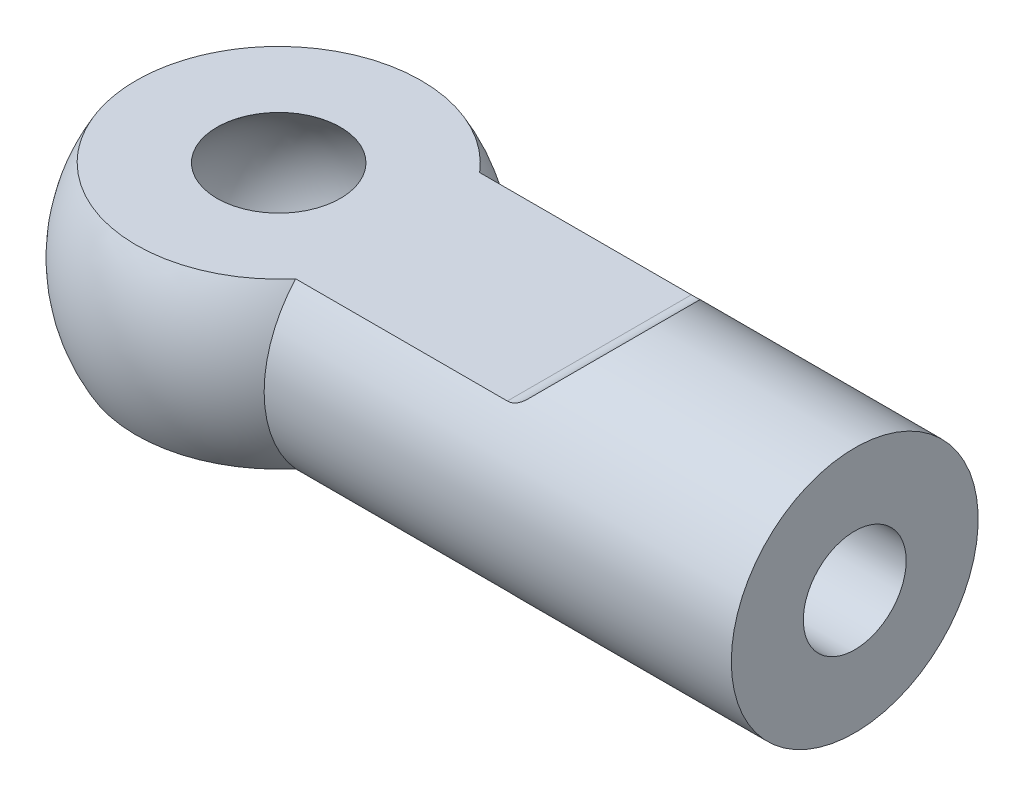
ISO-10303-21;
HEADER;
FILE_DESCRIPTION(('STEP AP214'),'2;1');
FILE_NAME('part.step','',(''),(''),'','','');
FILE_SCHEMA(('AUTOMOTIVE_DESIGN { 1 0 10303 214 1 1 1 1 }'));
ENDSEC;
DATA;
#1=APPLICATION_CONTEXT('core data for automotive mechanical design processes');
#2=APPLICATION_PROTOCOL_DEFINITION('international standard','automotive_design',2000,#1);
#3=PRODUCT_CONTEXT('',#1,'mechanical');
#4=PRODUCT('Part','Part','',(#3));
#5=PRODUCT_RELATED_PRODUCT_CATEGORY('part','',(#4));
#6=PRODUCT_DEFINITION_FORMATION('','',#4);
#7=PRODUCT_DEFINITION_CONTEXT('part definition',#1,'design');
#8=PRODUCT_DEFINITION('design','',#6,#7);
#9=PRODUCT_DEFINITION_SHAPE('','',#8);
#10=(LENGTH_UNIT() NAMED_UNIT(*) SI_UNIT(.MILLI.,.METRE.));
#11=(NAMED_UNIT(*) PLANE_ANGLE_UNIT() SI_UNIT($,.RADIAN.));
#12=(NAMED_UNIT(*) SI_UNIT($,.STERADIAN.) SOLID_ANGLE_UNIT());
#13=UNCERTAINTY_MEASURE_WITH_UNIT(LENGTH_MEASURE(1.E-05),#10,'distance_accuracy_value','');
#14=(GEOMETRIC_REPRESENTATION_CONTEXT(3) GLOBAL_UNCERTAINTY_ASSIGNED_CONTEXT((#13)) GLOBAL_UNIT_ASSIGNED_CONTEXT((#10,
#11,#12)) REPRESENTATION_CONTEXT('',''));
#15=CARTESIAN_POINT('',(0.,0.,0.));
#16=DIRECTION('',(0.,0.,1.));
#17=DIRECTION('',(1.,0.,0.));
#18=AXIS2_PLACEMENT_3D('',#15,#16,#17);
#19=CARTESIAN_POINT('',(0.,0.,0.));
#20=DIRECTION('',(-1.,0.,0.));
#21=DIRECTION('',(0.,0.,1.));
#22=AXIS2_PLACEMENT_3D('',#19,#20,#21);
#23=CYLINDRICAL_SURFACE('',#22,3.);
#24=CARTESIAN_POINT('',(14.,0.,0.));
#25=DIRECTION('',(-1.,0.,0.));
#26=DIRECTION('',(0.,0.,1.));
#27=AXIS2_PLACEMENT_3D('',#24,#25,#26);
#28=CIRCLE('',#27,3.);
#29=CARTESIAN_POINT('',(14.,0.,3.));
#30=VERTEX_POINT('',#29);
#31=EDGE_CURVE('E441',#30,#30,#28,.T.);
#32=ORIENTED_EDGE('',*,*,#31,.T.);
#33=EDGE_LOOP('',(#32));
#34=FACE_BOUND('',#33,.T.);
#35=DIRECTION('',(-1.,0.,0.));
#36=VECTOR('',#35,1.);
#37=CARTESIAN_POINT('',(0.,-2.,2.23606797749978));
#38=LINE('',#37,#36);
#39=CARTESIAN_POINT('',(2.6457513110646,-2.,2.23606797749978));
#40=VERTEX_POINT('',#39);
#41=CARTESIAN_POINT('',(7.79289321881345,-2.,2.23606797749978));
#42=VERTEX_POINT('',#41);
#43=EDGE_CURVE('E424',#40,#42,#38,.F.);
#44=ORIENTED_EDGE('',*,*,#43,.T.);
#45=CARTESIAN_POINT('',(7.79289321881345,-2.,2.23606797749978));
#46=CARTESIAN_POINT('',(7.81564348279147,-1.9999628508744,2.23609073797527));
#47=CARTESIAN_POINT('',(7.83835658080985,-2.00155029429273,2.23468148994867));
#48=CARTESIAN_POINT('',(7.88283202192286,-2.00765885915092,2.22920042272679));
#49=CARTESIAN_POINT('',(7.90460147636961,-2.01215122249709,2.22515470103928));
#50=CARTESIAN_POINT('',(7.94675574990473,-2.02375741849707,2.21460221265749));
#51=CARTESIAN_POINT('',(7.96714227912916,-2.03086794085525,2.20809855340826));
#52=CARTESIAN_POINT('',(8.00622199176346,-2.04729507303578,2.19287707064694));
#53=CARTESIAN_POINT('',(8.02490733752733,-2.05662124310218,2.1841496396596));
#54=CARTESIAN_POINT('',(8.06262231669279,-2.07835769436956,2.16348786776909));
#55=CARTESIAN_POINT('',(8.08135643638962,-2.09101453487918,2.15127938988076));
#56=CARTESIAN_POINT('',(8.11599095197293,-2.11778814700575,2.12493153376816));
#57=CARTESIAN_POINT('',(8.13190935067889,-2.13189465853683,2.11080552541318));
#58=CARTESIAN_POINT('',(8.14644660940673,-2.14644660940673,2.09589287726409));
#59=B_SPLINE_CURVE_WITH_KNOTS('',3,(#45,#46,#47,#48,#49,#50,#51,#52,#53,#54,#55,#56,#57,#58),
.UNSPECIFIED.,.F.,.F.,(4,2,2,2,2,2,4),(0.,0.0680932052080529,0.135522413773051,
0.202866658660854,0.270506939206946,0.347299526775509,0.423581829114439),.UNSPECIFIED.);
#60=CARTESIAN_POINT('',(8.14644660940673,-2.14644660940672,2.09589287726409));
#61=VERTEX_POINT('',#60);
#62=EDGE_CURVE('E11',#42,#61,#59,.T.);
#63=ORIENTED_EDGE('',*,*,#62,.T.);
#64=CARTESIAN_POINT('',(5.99999999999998,0.,0.));
#65=DIRECTION('',(0.707106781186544,0.707106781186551,0.));
#66=DIRECTION('',(-0.707106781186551,0.707106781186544,0.));
#67=AXIS2_PLACEMENT_3D('',#64,#65,#66);
#68=ELLIPSE('',#67,4.2426406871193,3.);
#69=CARTESIAN_POINT('',(8.14644660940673,-2.14644660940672,-2.09589287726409));
#70=VERTEX_POINT('',#69);
#71=EDGE_CURVE('E511',#61,#70,#68,.T.);
#72=ORIENTED_EDGE('',*,*,#71,.T.);
#73=CARTESIAN_POINT('',(8.14644660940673,-2.14644660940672,-2.09589287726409));
#74=CARTESIAN_POINT('',(8.13093845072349,-2.13091869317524,-2.11180744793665));
#75=CARTESIAN_POINT('',(8.1138494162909,-2.11589564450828,-2.12682631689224));
#76=CARTESIAN_POINT('',(8.07642523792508,-2.08749027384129,-2.15470922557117));
#77=CARTESIAN_POINT('',(8.05605806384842,-2.07412672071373,-2.16754912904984));
#78=CARTESIAN_POINT('',(8.01215742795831,-2.04993821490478,-2.19044220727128));
#79=CARTESIAN_POINT('',(7.98860137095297,-2.03913304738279,-2.20047376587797));
#80=CARTESIAN_POINT('',(7.93913757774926,-2.02114968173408,-2.21700335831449));
#81=CARTESIAN_POINT('',(7.91324645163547,-2.01394793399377,-2.22352435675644));
#82=CARTESIAN_POINT('',(7.87137788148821,-2.00595258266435,-2.23073297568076));
#83=CARTESIAN_POINT('',(7.85587806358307,-2.00373600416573,-2.23272226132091));
#84=CARTESIAN_POINT('',(7.82455572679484,-2.0007531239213,-2.23539443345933));
#85=CARTESIAN_POINT('',(7.80873204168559,-1.9999936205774,-2.23607119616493));
#86=CARTESIAN_POINT('',(7.79289321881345,-2.,-2.23606797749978));
#87=B_SPLINE_CURVE_WITH_KNOTS('',3,(#73,#74,#75,#76,#77,#78,#79,#80,#81,#82,#83,#84,#85,#86),
.UNSPECIFIED.,.F.,.F.,(4,2,2,2,2,2,4),(0.,0.0814016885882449,0.163653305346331,
0.246521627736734,0.328841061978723,0.37607726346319,0.423533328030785),.UNSPECIFIED.);
#88=CARTESIAN_POINT('',(7.79289321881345,-2.,-2.23606797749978));
#89=VERTEX_POINT('',#88);
#90=EDGE_CURVE('E362',#70,#89,#87,.T.);
#91=ORIENTED_EDGE('',*,*,#90,.T.);
#92=DIRECTION('',(-1.,0.,0.));
#93=VECTOR('',#92,1.);
#94=CARTESIAN_POINT('',(0.,-2.,-2.23606797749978));
#95=LINE('',#94,#93);
#96=CARTESIAN_POINT('',(2.6457513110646,-2.,-2.23606797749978));
#97=VERTEX_POINT('',#96);
#98=EDGE_CURVE('E426',#89,#97,#95,.T.);
#99=ORIENTED_EDGE('',*,*,#98,.T.);
#100=CARTESIAN_POINT('',(2.6457513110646,0.,0.));
#101=DIRECTION('',(-1.,0.,0.));
#102=DIRECTION('',(0.,0.,1.));
#103=AXIS2_PLACEMENT_3D('',#100,#101,#102);
#104=CIRCLE('',#103,3.);
#105=CARTESIAN_POINT('',(2.6457513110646,2.,-2.23606797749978));
#106=VERTEX_POINT('',#105);
#107=EDGE_CURVE('E438',#106,#97,#104,.T.);
#108=ORIENTED_EDGE('',*,*,#107,.F.);
#109=DIRECTION('',(-1.,0.,0.));
#110=VECTOR('',#109,1.);
#111=CARTESIAN_POINT('',(0.,2.,-2.23606797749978));
#112=LINE('',#111,#110);
#113=CARTESIAN_POINT('',(7.79289321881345,2.,-2.23606797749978));
#114=VERTEX_POINT('',#113);
#115=EDGE_CURVE('E435',#114,#106,#112,.T.);
#116=ORIENTED_EDGE('',*,*,#115,.F.);
#117=CARTESIAN_POINT('',(7.79289321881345,2.,-2.23606797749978));
#118=CARTESIAN_POINT('',(7.81564348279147,1.9999628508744,-2.23609073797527));
#119=CARTESIAN_POINT('',(7.83835658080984,2.00155029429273,-2.23468148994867));
#120=CARTESIAN_POINT('',(7.88283202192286,2.00765885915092,-2.22920042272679));
#121=CARTESIAN_POINT('',(7.90460147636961,2.01215122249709,-2.22515470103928));
#122=CARTESIAN_POINT('',(7.94675574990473,2.02375741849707,-2.21460221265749));
#123=CARTESIAN_POINT('',(7.96714227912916,2.03086794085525,-2.20809855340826));
#124=CARTESIAN_POINT('',(8.00622199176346,2.04729507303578,-2.19287707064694));
#125=CARTESIAN_POINT('',(8.02490733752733,2.05662124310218,-2.1841496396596));
#126=CARTESIAN_POINT('',(8.06262231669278,2.07835769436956,-2.16348786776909));
#127=CARTESIAN_POINT('',(8.08135643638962,2.09101453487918,-2.15127938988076));
#128=CARTESIAN_POINT('',(8.11599095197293,2.11778814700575,-2.12493153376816));
#129=CARTESIAN_POINT('',(8.13190935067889,2.13189465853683,-2.11080552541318));
#130=CARTESIAN_POINT('',(8.14644660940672,2.14644660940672,-2.09589287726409));
#131=B_SPLINE_CURVE_WITH_KNOTS('',3,(#117,#118,#119,#120,#121,#122,#123,#124,#125,#126,#127,
#128,#129,#130),.UNSPECIFIED.,.F.,.F.,(4,2,2,2,2,2,4),(0.,0.0680932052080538,0.135522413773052,
0.202866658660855,0.270506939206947,0.34729952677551,0.423581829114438),.UNSPECIFIED.);
#132=CARTESIAN_POINT('',(8.14644660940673,2.14644660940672,-2.09589287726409));
#133=VERTEX_POINT('',#132);
#134=EDGE_CURVE('E454',#114,#133,#131,.T.);
#135=ORIENTED_EDGE('',*,*,#134,.T.);
#136=CARTESIAN_POINT('',(5.99999999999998,0.,0.));
#137=DIRECTION('',(-0.707106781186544,0.707106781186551,0.));
#138=DIRECTION('',(-0.707106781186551,-0.707106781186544,0.));
#139=AXIS2_PLACEMENT_3D('',#136,#137,#138);
#140=ELLIPSE('',#139,4.2426406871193,3.);
#141=CARTESIAN_POINT('',(8.14644660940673,2.14644660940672,2.09589287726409));
#142=VERTEX_POINT('',#141);
#143=EDGE_CURVE('E444',#142,#133,#140,.T.);
#144=ORIENTED_EDGE('',*,*,#143,.F.);
#145=CARTESIAN_POINT('',(8.14644660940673,2.14644660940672,2.09589287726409));
#146=CARTESIAN_POINT('',(8.13093845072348,2.13091869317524,2.11180744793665));
#147=CARTESIAN_POINT('',(8.11384941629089,2.11589564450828,2.12682631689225));
#148=CARTESIAN_POINT('',(8.07642523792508,2.08749027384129,2.15470922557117));
#149=CARTESIAN_POINT('',(8.05605806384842,2.07412672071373,2.16754912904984));
#150=CARTESIAN_POINT('',(8.01215742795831,2.04993821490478,2.19044220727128));
#151=CARTESIAN_POINT('',(7.98860137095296,2.03913304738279,2.20047376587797));
#152=CARTESIAN_POINT('',(7.93913757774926,2.02114968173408,2.21700335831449));
#153=CARTESIAN_POINT('',(7.91324645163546,2.01394793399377,2.22352435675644));
#154=CARTESIAN_POINT('',(7.87137788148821,2.00595258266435,2.23073297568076));
#155=CARTESIAN_POINT('',(7.85587806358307,2.00373600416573,2.23272226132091));
#156=CARTESIAN_POINT('',(7.82455572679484,2.0007531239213,2.23539443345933));
#157=CARTESIAN_POINT('',(7.80873204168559,1.9999936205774,2.23607119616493));
#158=CARTESIAN_POINT('',(7.79289321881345,2.,2.23606797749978));
#159=B_SPLINE_CURVE_WITH_KNOTS('',3,(#145,#146,#147,#148,#149,#150,#151,#152,#153,#154,#155,
#156,#157,#158),.UNSPECIFIED.,.F.,.F.,(4,2,2,2,2,2,4),(0.,0.081401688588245,0.163653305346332,
0.246521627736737,0.328841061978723,0.376077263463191,0.423533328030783),.UNSPECIFIED.);
#160=CARTESIAN_POINT('',(7.79289321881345,2.,2.23606797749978));
#161=VERTEX_POINT('',#160);
#162=EDGE_CURVE('E460',#142,#161,#159,.T.);
#163=ORIENTED_EDGE('',*,*,#162,.T.);
#164=DIRECTION('',(-1.,0.,0.));
#165=VECTOR('',#164,1.);
#166=CARTESIAN_POINT('',(0.,2.,2.23606797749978));
#167=LINE('',#166,#165);
#168=CARTESIAN_POINT('',(2.6457513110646,2.,2.23606797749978));
#169=VERTEX_POINT('',#168);
#170=EDGE_CURVE('E432',#169,#161,#167,.F.);
#171=ORIENTED_EDGE('',*,*,#170,.F.);
#172=EDGE_CURVE('E437',#40,#169,#104,.T.);
#173=ORIENTED_EDGE('',*,*,#172,.F.);
#174=EDGE_LOOP('',(#44,#63,#72,#91,#99,#108,#116,#135,#144,#163,#171,#173));
#175=FACE_BOUND('',#174,.T.);
#176=ADVANCED_FACE('F350',(#34,#175),#23,.T.);
#177=CARTESIAN_POINT('',(0.,0.,0.));
#178=DIRECTION('',(-1.,0.,0.));
#179=DIRECTION('',(0.,1.,0.));
#180=AXIS2_PLACEMENT_3D('',#177,#178,#179);
#181=SPHERICAL_SURFACE('',#180,4.);
#182=ORIENTED_EDGE('',*,*,#107,.T.);
#183=CARTESIAN_POINT('',(0.,-2.,0.));
#184=DIRECTION('',(0.,1.,0.));
#185=DIRECTION('',(0.,0.,1.));
#186=AXIS2_PLACEMENT_3D('',#183,#184,#185);
#187=CIRCLE('',#186,3.46410161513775);
#188=EDGE_CURVE('E421',#97,#40,#187,.T.);
#189=ORIENTED_EDGE('',*,*,#188,.T.);
#190=ORIENTED_EDGE('',*,*,#172,.T.);
#191=CARTESIAN_POINT('',(0.,2.,0.));
#192=DIRECTION('',(0.,1.,0.));
#193=DIRECTION('',(0.,0.,1.));
#194=AXIS2_PLACEMENT_3D('',#191,#192,#193);
#195=CIRCLE('',#194,3.46410161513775);
#196=EDGE_CURVE('E429',#106,#169,#195,.T.);
#197=ORIENTED_EDGE('',*,*,#196,.F.);
#198=EDGE_LOOP('',(#182,#189,#190,#197));
#199=FACE_BOUND('',#198,.T.);
#200=ADVANCED_FACE('F487',(#199),#181,.T.);
#201=CARTESIAN_POINT('',(14.,0.,0.));
#202=DIRECTION('',(-1.,0.,0.));
#203=DIRECTION('',(0.,0.,1.));
#204=AXIS2_PLACEMENT_3D('',#201,#202,#203);
#205=PLANE('',#204);
#206=CARTESIAN_POINT('',(14.,0.,0.));
#207=DIRECTION('',(1.,0.,0.));
#208=DIRECTION('',(0.,0.,-1.));
#209=AXIS2_PLACEMENT_3D('',#206,#207,#208);
#210=CIRCLE('',#209,1.25);
#211=CARTESIAN_POINT('',(14.,0.,-1.25));
#212=VERTEX_POINT('',#211);
#213=EDGE_CURVE('E415',#212,#212,#210,.T.);
#214=ORIENTED_EDGE('',*,*,#213,.F.);
#215=EDGE_LOOP('',(#214));
#216=FACE_BOUND('',#215,.T.);
#217=ORIENTED_EDGE('',*,*,#31,.F.);
#218=EDGE_LOOP('',(#217));
#219=FACE_BOUND('',#218,.T.);
#220=ADVANCED_FACE('F352',(#216,#219),#205,.F.);
#221=CARTESIAN_POINT('',(8.,2.,4.));
#222=DIRECTION('',(-0.707106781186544,0.707106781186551,0.));
#223=DIRECTION('',(-0.707106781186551,-0.707106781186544,0.));
#224=AXIS2_PLACEMENT_3D('',#221,#222,#223);
#225=PLANE('',#224);
#226=ORIENTED_EDGE('',*,*,#143,.T.);
#227=DIRECTION('',(0.,0.,-1.));
#228=VECTOR('',#227,1.);
#229=CARTESIAN_POINT('',(8.14644660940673,2.14644660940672,2.23606797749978));
#230=LINE('',#229,#228);
#231=EDGE_CURVE('E452',#133,#142,#230,.F.);
#232=ORIENTED_EDGE('',*,*,#231,.T.);
#233=EDGE_LOOP('',(#226,#232));
#234=FACE_BOUND('',#233,.T.);
#235=ADVANCED_FACE('F476',(#234),#225,.T.);
#236=CARTESIAN_POINT('',(-4.99999999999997,2.,4.));
#237=DIRECTION('',(0.,1.,0.));
#238=DIRECTION('',(0.,0.,1.));
#239=AXIS2_PLACEMENT_3D('',#236,#237,#238);
#240=PLANE('',#239);
#241=CARTESIAN_POINT('',(0.,2.,0.));
#242=DIRECTION('',(0.,1.,0.));
#243=DIRECTION('',(0.,0.,1.));
#244=AXIS2_PLACEMENT_3D('',#241,#242,#243);
#245=CIRCLE('',#244,1.5);
#246=CARTESIAN_POINT('',(0.,2.,1.5));
#247=VERTEX_POINT('',#246);
#248=EDGE_CURVE('E428',#247,#247,#245,.F.);
#249=ORIENTED_EDGE('',*,*,#248,.T.);
#250=EDGE_LOOP('',(#249));
#251=FACE_BOUND('',#250,.T.);
#252=ORIENTED_EDGE('',*,*,#170,.T.);
#253=DIRECTION('',(0.,0.,-1.));
#254=VECTOR('',#253,1.);
#255=CARTESIAN_POINT('',(7.79289321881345,2.,-2.23606797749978));
#256=LINE('',#255,#254);
#257=EDGE_CURVE('E449',#161,#114,#256,.T.);
#258=ORIENTED_EDGE('',*,*,#257,.T.);
#259=ORIENTED_EDGE('',*,*,#115,.T.);
#260=ORIENTED_EDGE('',*,*,#196,.T.);
#261=EDGE_LOOP('',(#252,#258,#259,#260));
#262=FACE_BOUND('',#261,.T.);
#263=ADVANCED_FACE('F480',(#251,#262),#240,.T.);
#264=CARTESIAN_POINT('',(0.,0.,0.));
#265=DIRECTION('',(-1.,0.,0.));
#266=DIRECTION('',(0.,-1.,0.));
#267=AXIS2_PLACEMENT_3D('',#264,#265,#266);
#268=SPHERICAL_SURFACE('',#267,2.5);
#269=CARTESIAN_POINT('',(0.,0.,0.));
#270=DIRECTION('',(0.,1.,0.));
#271=DIRECTION('',(0.,0.,1.));
#272=AXIS2_PLACEMENT_3D('',#269,#270,#271);
#273=SPHERICAL_SURFACE('',#272,2.5);
#274=CARTESIAN_POINT('',(0.,-2.,0.));
#275=DIRECTION('',(0.,1.,0.));
#276=DIRECTION('',(0.,0.,1.));
#277=AXIS2_PLACEMENT_3D('',#274,#275,#276);
#278=CIRCLE('',#277,1.5);
#279=CARTESIAN_POINT('',(0.,-2.,1.5));
#280=VERTEX_POINT('',#279);
#281=EDGE_CURVE('E418',#280,#280,#278,.F.);
#282=ORIENTED_EDGE('',*,*,#281,.T.);
#283=EDGE_LOOP('',(#282));
#284=FACE_BOUND('',#283,.T.);
#285=ORIENTED_EDGE('',*,*,#248,.F.);
#286=EDGE_LOOP('',(#285));
#287=FACE_BOUND('',#286,.T.);
#288=ADVANCED_FACE('F473',(#284,#287),#273,.F.);
#289=CARTESIAN_POINT('',(7.79289321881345,2.5,4.));
#290=DIRECTION('',(0.,0.,1.));
#291=DIRECTION('',(1.,0.,0.));
#292=AXIS2_PLACEMENT_3D('',#289,#290,#291);
#293=CYLINDRICAL_SURFACE('',#292,0.5);
#294=ORIENTED_EDGE('',*,*,#162,.F.);
#295=ORIENTED_EDGE('',*,*,#231,.F.);
#296=ORIENTED_EDGE('',*,*,#134,.F.);
#297=ORIENTED_EDGE('',*,*,#257,.F.);
#298=EDGE_LOOP('',(#294,#295,#296,#297));
#299=FACE_BOUND('',#298,.T.);
#300=ADVANCED_FACE('F467',(#299),#293,.F.);
#301=CARTESIAN_POINT('',(8.,-2.,4.));
#302=DIRECTION('',(0.707106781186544,0.707106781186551,0.));
#303=DIRECTION('',(-0.707106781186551,0.707106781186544,0.));
#304=AXIS2_PLACEMENT_3D('',#301,#302,#303);
#305=PLANE('',#304);
#306=ORIENTED_EDGE('',*,*,#71,.F.);
#307=DIRECTION('',(0.,0.,-1.));
#308=VECTOR('',#307,1.);
#309=CARTESIAN_POINT('',(8.14644660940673,-2.14644660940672,-2.23606797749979));
#310=LINE('',#309,#308);
#311=EDGE_CURVE('E509',#61,#70,#310,.T.);
#312=ORIENTED_EDGE('',*,*,#311,.T.);
#313=EDGE_LOOP('',(#306,#312));
#314=FACE_BOUND('',#313,.T.);
#315=ADVANCED_FACE('F472',(#314),#305,.F.);
#316=CARTESIAN_POINT('',(-4.99999999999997,-2.,4.));
#317=DIRECTION('',(0.,1.,0.));
#318=DIRECTION('',(0.,0.,1.));
#319=AXIS2_PLACEMENT_3D('',#316,#317,#318);
#320=PLANE('',#319);
#321=ORIENTED_EDGE('',*,*,#281,.F.);
#322=EDGE_LOOP('',(#321));
#323=FACE_BOUND('',#322,.T.);
#324=ORIENTED_EDGE('',*,*,#98,.F.);
#325=DIRECTION('',(0.,0.,-1.));
#326=VECTOR('',#325,1.);
#327=CARTESIAN_POINT('',(7.79289321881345,-2.,2.23606797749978));
#328=LINE('',#327,#326);
#329=EDGE_CURVE('E375',#89,#42,#328,.F.);
#330=ORIENTED_EDGE('',*,*,#329,.T.);
#331=ORIENTED_EDGE('',*,*,#43,.F.);
#332=ORIENTED_EDGE('',*,*,#188,.F.);
#333=EDGE_LOOP('',(#324,#330,#331,#332));
#334=FACE_BOUND('',#333,.T.);
#335=ADVANCED_FACE('F501',(#323,#334),#320,.F.);
#336=CARTESIAN_POINT('',(7.79289321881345,-2.5,4.));
#337=DIRECTION('',(0.,0.,1.));
#338=DIRECTION('',(1.,0.,0.));
#339=AXIS2_PLACEMENT_3D('',#336,#337,#338);
#340=CYLINDRICAL_SURFACE('',#339,0.5);
#341=ORIENTED_EDGE('',*,*,#62,.F.);
#342=ORIENTED_EDGE('',*,*,#329,.F.);
#343=ORIENTED_EDGE('',*,*,#90,.F.);
#344=ORIENTED_EDGE('',*,*,#311,.F.);
#345=EDGE_LOOP('',(#341,#342,#343,#344));
#346=FACE_BOUND('',#345,.T.);
#347=ADVANCED_FACE('F507',(#346),#340,.F.);
#348=CARTESIAN_POINT('',(14.,0.,0.));
#349=DIRECTION('',(1.,0.,0.));
#350=DIRECTION('',(0.,0.,-1.));
#351=AXIS2_PLACEMENT_3D('',#348,#349,#350);
#352=CYLINDRICAL_SURFACE('',#351,1.25);
#353=CARTESIAN_POINT('',(5.5,0.,0.));
#354=DIRECTION('',(1.,0.,0.));
#355=DIRECTION('',(0.,0.,-1.));
#356=AXIS2_PLACEMENT_3D('',#353,#354,#355);
#357=CIRCLE('',#356,1.25);
#358=CARTESIAN_POINT('',(5.5,0.,-1.25));
#359=VERTEX_POINT('',#358);
#360=EDGE_CURVE('E413',#359,#359,#357,.T.);
#361=ORIENTED_EDGE('',*,*,#360,.F.);
#362=EDGE_LOOP('',(#361));
#363=FACE_BOUND('',#362,.T.);
#364=ORIENTED_EDGE('',*,*,#213,.T.);
#365=EDGE_LOOP('',(#364));
#366=FACE_BOUND('',#365,.T.);
#367=ADVANCED_FACE('F409',(#363,#366),#352,.F.);
#368=CARTESIAN_POINT('',(5.5,0.,0.));
#369=DIRECTION('',(1.,0.,0.));
#370=DIRECTION('',(0.,0.,-1.));
#371=AXIS2_PLACEMENT_3D('',#368,#369,#370);
#372=CONICAL_SURFACE('',#371,1.25,1.02974425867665);
#373=CARTESIAN_POINT('',(4.74892422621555,0.,0.));
#374=VERTEX_POINT('',#373);
#375=VERTEX_LOOP('',#374);
#376=FACE_BOUND('',#375,.T.);
#377=ORIENTED_EDGE('',*,*,#360,.T.);
#378=EDGE_LOOP('',(#377));
#379=FACE_BOUND('',#378,.T.);
#380=ADVANCED_FACE('F406',(#376,#379),#372,.F.);
#381=CLOSED_SHELL('',(#176,#200,#220,#235,#263,#288,#300,#315,#335,#347,#367,#380));
#382=MANIFOLD_SOLID_BREP('B2',#381);
#383=ADVANCED_BREP_SHAPE_REPRESENTATION('',(#18,#382),#14);
#384=SHAPE_DEFINITION_REPRESENTATION(#9,#383);
ENDSEC;
END-ISO-10303-21;
